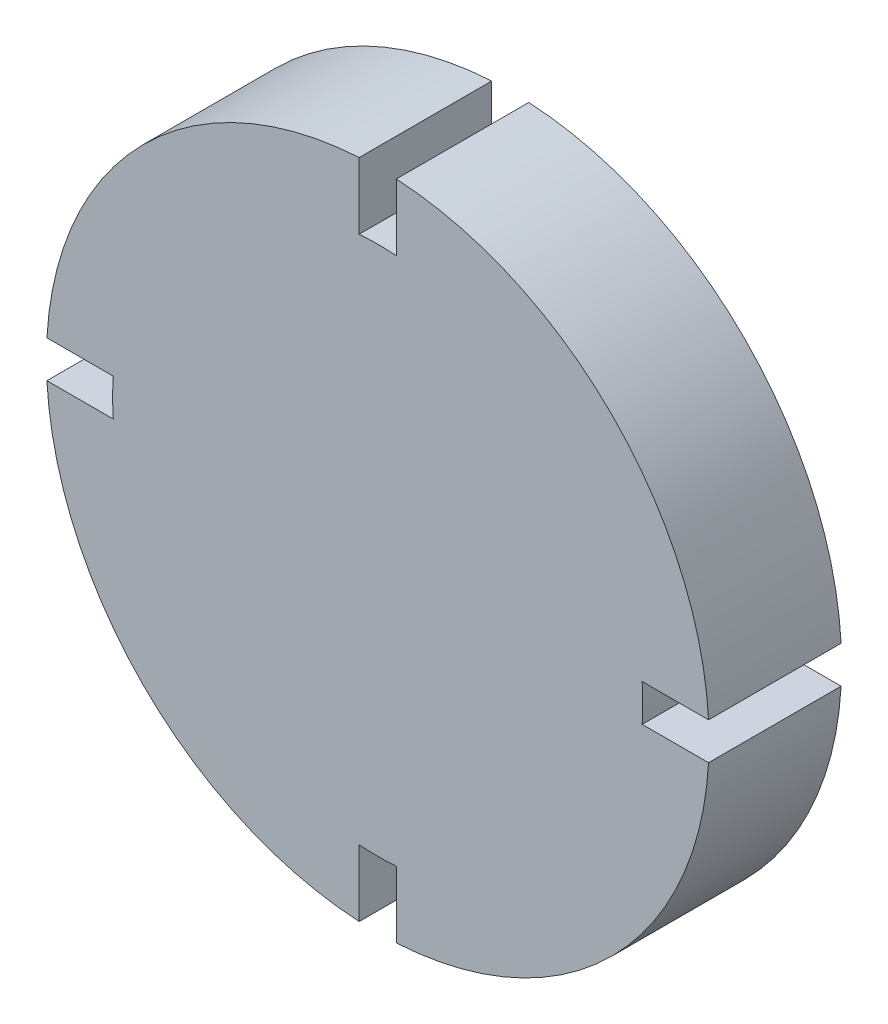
ISO-10303-21;
HEADER;
FILE_DESCRIPTION(('STEP AP214'),'2;1');
FILE_NAME('part.step','',(''),(''),'','','');
FILE_SCHEMA(('AUTOMOTIVE_DESIGN { 1 0 10303 214 1 1 1 1 }'));
ENDSEC;
DATA;
#1=APPLICATION_CONTEXT('core data for automotive mechanical design processes');
#2=APPLICATION_PROTOCOL_DEFINITION('international standard','automotive_design',2000,#1);
#3=PRODUCT_CONTEXT('',#1,'mechanical');
#4=PRODUCT('Part','Part','',(#3));
#5=PRODUCT_RELATED_PRODUCT_CATEGORY('part','',(#4));
#6=PRODUCT_DEFINITION_FORMATION('','',#4);
#7=PRODUCT_DEFINITION_CONTEXT('part definition',#1,'design');
#8=PRODUCT_DEFINITION('design','',#6,#7);
#9=PRODUCT_DEFINITION_SHAPE('','',#8);
#10=(LENGTH_UNIT() NAMED_UNIT(*) SI_UNIT(.MILLI.,.METRE.));
#11=(NAMED_UNIT(*) PLANE_ANGLE_UNIT() SI_UNIT($,.RADIAN.));
#12=(NAMED_UNIT(*) SI_UNIT($,.STERADIAN.) SOLID_ANGLE_UNIT());
#13=UNCERTAINTY_MEASURE_WITH_UNIT(LENGTH_MEASURE(1.E-05),#10,'distance_accuracy_value','');
#14=(GEOMETRIC_REPRESENTATION_CONTEXT(3) GLOBAL_UNCERTAINTY_ASSIGNED_CONTEXT((#13)) GLOBAL_UNIT_ASSIGNED_CONTEXT((#10,
#11,#12)) REPRESENTATION_CONTEXT('',''));
#15=CARTESIAN_POINT('',(0.,0.,0.));
#16=DIRECTION('',(0.,0.,1.));
#17=DIRECTION('',(1.,0.,0.));
#18=AXIS2_PLACEMENT_3D('',#15,#16,#17);
#19=CARTESIAN_POINT('',(0.,0.,10.));
#20=DIRECTION('',(0.,0.,-1.));
#21=DIRECTION('',(-1.,0.,0.));
#22=AXIS2_PLACEMENT_3D('',#19,#20,#21);
#23=CYLINDRICAL_SURFACE('',#22,25.);
#24=CARTESIAN_POINT('',(0.,0.,0.));
#25=DIRECTION('',(0.,0.,1.));
#26=DIRECTION('',(1.,0.,0.));
#27=AXIS2_PLACEMENT_3D('',#24,#25,#26);
#28=CIRCLE('',#27,25.);
#29=CARTESIAN_POINT('',(-1.4,24.9607692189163,0.));
#30=VERTEX_POINT('',#29);
#31=CARTESIAN_POINT('',(-24.9607692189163,1.4,0.));
#32=VERTEX_POINT('',#31);
#33=EDGE_CURVE('E177',#30,#32,#28,.T.);
#34=ORIENTED_EDGE('',*,*,#33,.T.);
#35=DIRECTION('',(0.,0.,-1.));
#36=VECTOR('',#35,1.);
#37=CARTESIAN_POINT('',(-24.9607692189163,1.4,10.));
#38=LINE('',#37,#36);
#39=CARTESIAN_POINT('',(-24.9607692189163,1.4,10.));
#40=VERTEX_POINT('',#39);
#41=EDGE_CURVE('E11',#40,#32,#38,.T.);
#42=ORIENTED_EDGE('',*,*,#41,.F.);
#43=CARTESIAN_POINT('',(0.,0.,10.));
#44=DIRECTION('',(0.,0.,1.));
#45=DIRECTION('',(1.,0.,0.));
#46=AXIS2_PLACEMENT_3D('',#43,#44,#45);
#47=CIRCLE('',#46,25.);
#48=CARTESIAN_POINT('',(-1.4,24.9607692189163,10.));
#49=VERTEX_POINT('',#48);
#50=EDGE_CURVE('E207',#49,#40,#47,.T.);
#51=ORIENTED_EDGE('',*,*,#50,.F.);
#52=DIRECTION('',(0.,0.,-1.));
#53=VECTOR('',#52,1.);
#54=CARTESIAN_POINT('',(-1.4,24.9607692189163,10.));
#55=LINE('',#54,#53);
#56=EDGE_CURVE('E173',#49,#30,#55,.T.);
#57=ORIENTED_EDGE('',*,*,#56,.T.);
#58=EDGE_LOOP('',(#34,#42,#51,#57));
#59=FACE_BOUND('',#58,.T.);
#60=ADVANCED_FACE('F33',(#59),#23,.T.);
#61=CARTESIAN_POINT('',(-24.9607692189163,1.4,10.));
#62=DIRECTION('',(0.,1.,0.));
#63=DIRECTION('',(-1.,0.,0.));
#64=AXIS2_PLACEMENT_3D('',#61,#62,#63);
#65=PLANE('',#64);
#66=DIRECTION('',(1.,0.,0.));
#67=VECTOR('',#66,1.);
#68=CARTESIAN_POINT('',(-24.9607692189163,1.4,0.));
#69=LINE('',#68,#67);
#70=CARTESIAN_POINT('',(-19.9509398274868,1.4,0.));
#71=VERTEX_POINT('',#70);
#72=EDGE_CURVE('E180',#32,#71,#69,.T.);
#73=ORIENTED_EDGE('',*,*,#72,.T.);
#74=DIRECTION('',(0.,0.,-1.));
#75=VECTOR('',#74,1.);
#76=CARTESIAN_POINT('',(-19.9509398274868,1.4,10.));
#77=LINE('',#76,#75);
#78=CARTESIAN_POINT('',(-19.9509398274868,1.4,10.));
#79=VERTEX_POINT('',#78);
#80=EDGE_CURVE('E41',#79,#71,#77,.T.);
#81=ORIENTED_EDGE('',*,*,#80,.F.);
#82=DIRECTION('',(1.,0.,0.));
#83=VECTOR('',#82,1.);
#84=CARTESIAN_POINT('',(-24.9607692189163,1.4,10.));
#85=LINE('',#84,#83);
#86=EDGE_CURVE('E116',#40,#79,#85,.T.);
#87=ORIENTED_EDGE('',*,*,#86,.F.);
#88=ORIENTED_EDGE('',*,*,#41,.T.);
#89=EDGE_LOOP('',(#73,#81,#87,#88));
#90=FACE_BOUND('',#89,.T.);
#91=ADVANCED_FACE('F305',(#90),#65,.F.);
#92=CARTESIAN_POINT('',(0.,0.,10.));
#93=DIRECTION('',(0.,0.,-1.));
#94=DIRECTION('',(-1.,0.,0.));
#95=AXIS2_PLACEMENT_3D('',#92,#93,#94);
#96=CYLINDRICAL_SURFACE('',#95,20.);
#97=CARTESIAN_POINT('',(0.,0.,0.));
#98=DIRECTION('',(0.,0.,1.));
#99=DIRECTION('',(1.,0.,0.));
#100=AXIS2_PLACEMENT_3D('',#97,#98,#99);
#101=CIRCLE('',#100,20.);
#102=CARTESIAN_POINT('',(-19.9509398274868,-1.40000000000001,0.));
#103=VERTEX_POINT('',#102);
#104=EDGE_CURVE('E182',#71,#103,#101,.T.);
#105=ORIENTED_EDGE('',*,*,#104,.T.);
#106=DIRECTION('',(0.,0.,-1.));
#107=VECTOR('',#106,1.);
#108=CARTESIAN_POINT('',(-19.9509398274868,-1.40000000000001,10.));
#109=LINE('',#108,#107);
#110=CARTESIAN_POINT('',(-19.9509398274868,-1.40000000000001,10.));
#111=VERTEX_POINT('',#110);
#112=EDGE_CURVE('E238',#111,#103,#109,.T.);
#113=ORIENTED_EDGE('',*,*,#112,.F.);
#114=CARTESIAN_POINT('',(0.,0.,10.));
#115=DIRECTION('',(0.,0.,1.));
#116=DIRECTION('',(1.,0.,0.));
#117=AXIS2_PLACEMENT_3D('',#114,#115,#116);
#118=CIRCLE('',#117,20.);
#119=EDGE_CURVE('E246',#79,#111,#118,.T.);
#120=ORIENTED_EDGE('',*,*,#119,.F.);
#121=ORIENTED_EDGE('',*,*,#80,.T.);
#122=EDGE_LOOP('',(#105,#113,#120,#121));
#123=FACE_BOUND('',#122,.T.);
#124=ADVANCED_FACE('F244',(#123),#96,.T.);
#125=CARTESIAN_POINT('',(-24.9607692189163,-1.40000000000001,10.));
#126=DIRECTION('',(0.,-1.,0.));
#127=DIRECTION('',(1.,0.,0.));
#128=AXIS2_PLACEMENT_3D('',#125,#126,#127);
#129=PLANE('',#128);
#130=DIRECTION('',(-1.,0.,0.));
#131=VECTOR('',#130,1.);
#132=CARTESIAN_POINT('',(-24.9607692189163,-1.40000000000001,0.));
#133=LINE('',#132,#131);
#134=CARTESIAN_POINT('',(-24.9607692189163,-1.4,0.));
#135=VERTEX_POINT('',#134);
#136=EDGE_CURVE('E184',#103,#135,#133,.T.);
#137=ORIENTED_EDGE('',*,*,#136,.T.);
#138=DIRECTION('',(0.,0.,-1.));
#139=VECTOR('',#138,1.);
#140=CARTESIAN_POINT('',(-24.9607692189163,-1.4,10.));
#141=LINE('',#140,#139);
#142=CARTESIAN_POINT('',(-24.9607692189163,-1.4,10.));
#143=VERTEX_POINT('',#142);
#144=EDGE_CURVE('E235',#143,#135,#141,.T.);
#145=ORIENTED_EDGE('',*,*,#144,.F.);
#146=DIRECTION('',(-1.,0.,0.));
#147=VECTOR('',#146,1.);
#148=CARTESIAN_POINT('',(-24.9607692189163,-1.40000000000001,10.));
#149=LINE('',#148,#147);
#150=EDGE_CURVE('E264',#111,#143,#149,.T.);
#151=ORIENTED_EDGE('',*,*,#150,.F.);
#152=ORIENTED_EDGE('',*,*,#112,.T.);
#153=EDGE_LOOP('',(#137,#145,#151,#152));
#154=FACE_BOUND('',#153,.T.);
#155=ADVANCED_FACE('F255',(#154),#129,.F.);
#156=CARTESIAN_POINT('',(0.,0.,10.));
#157=DIRECTION('',(0.,0.,-1.));
#158=DIRECTION('',(-1.,0.,0.));
#159=AXIS2_PLACEMENT_3D('',#156,#157,#158);
#160=CYLINDRICAL_SURFACE('',#159,25.);
#161=CARTESIAN_POINT('',(0.,0.,0.));
#162=DIRECTION('',(0.,0.,1.));
#163=DIRECTION('',(1.,0.,0.));
#164=AXIS2_PLACEMENT_3D('',#161,#162,#163);
#165=CIRCLE('',#164,25.);
#166=CARTESIAN_POINT('',(-1.4,-24.9607692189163,0.));
#167=VERTEX_POINT('',#166);
#168=EDGE_CURVE('E186',#135,#167,#165,.T.);
#169=ORIENTED_EDGE('',*,*,#168,.T.);
#170=DIRECTION('',(0.,0.,-1.));
#171=VECTOR('',#170,1.);
#172=CARTESIAN_POINT('',(-1.4,-24.9607692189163,10.));
#173=LINE('',#172,#171);
#174=CARTESIAN_POINT('',(-1.4,-24.9607692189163,10.));
#175=VERTEX_POINT('',#174);
#176=EDGE_CURVE('E232',#175,#167,#173,.T.);
#177=ORIENTED_EDGE('',*,*,#176,.F.);
#178=CARTESIAN_POINT('',(0.,0.,10.));
#179=DIRECTION('',(0.,0.,1.));
#180=DIRECTION('',(1.,0.,0.));
#181=AXIS2_PLACEMENT_3D('',#178,#179,#180);
#182=CIRCLE('',#181,25.);
#183=EDGE_CURVE('E261',#143,#175,#182,.T.);
#184=ORIENTED_EDGE('',*,*,#183,.F.);
#185=ORIENTED_EDGE('',*,*,#144,.T.);
#186=EDGE_LOOP('',(#169,#177,#184,#185));
#187=FACE_BOUND('',#186,.T.);
#188=ADVANCED_FACE('F259',(#187),#160,.T.);
#189=CARTESIAN_POINT('',(-1.4,-24.9607692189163,10.));
#190=DIRECTION('',(-1.,0.,0.));
#191=DIRECTION('',(0.,-1.,0.));
#192=AXIS2_PLACEMENT_3D('',#189,#190,#191);
#193=PLANE('',#192);
#194=DIRECTION('',(0.,1.,0.));
#195=VECTOR('',#194,1.);
#196=CARTESIAN_POINT('',(-1.4,-24.9607692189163,0.));
#197=LINE('',#196,#195);
#198=CARTESIAN_POINT('',(-1.4,-19.9509398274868,0.));
#199=VERTEX_POINT('',#198);
#200=EDGE_CURVE('E188',#167,#199,#197,.T.);
#201=ORIENTED_EDGE('',*,*,#200,.T.);
#202=DIRECTION('',(0.,0.,-1.));
#203=VECTOR('',#202,1.);
#204=CARTESIAN_POINT('',(-1.4,-19.9509398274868,10.));
#205=LINE('',#204,#203);
#206=CARTESIAN_POINT('',(-1.4,-19.9509398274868,10.));
#207=VERTEX_POINT('',#206);
#208=EDGE_CURVE('E229',#207,#199,#205,.T.);
#209=ORIENTED_EDGE('',*,*,#208,.F.);
#210=DIRECTION('',(0.,1.,0.));
#211=VECTOR('',#210,1.);
#212=CARTESIAN_POINT('',(-1.4,-24.9607692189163,10.));
#213=LINE('',#212,#211);
#214=EDGE_CURVE('E263',#175,#207,#213,.T.);
#215=ORIENTED_EDGE('',*,*,#214,.F.);
#216=ORIENTED_EDGE('',*,*,#176,.T.);
#217=EDGE_LOOP('',(#201,#209,#215,#216));
#218=FACE_BOUND('',#217,.T.);
#219=ADVANCED_FACE('F318',(#218),#193,.F.);
#220=CARTESIAN_POINT('',(0.,0.,10.));
#221=DIRECTION('',(0.,0.,-1.));
#222=DIRECTION('',(-1.,0.,0.));
#223=AXIS2_PLACEMENT_3D('',#220,#221,#222);
#224=CYLINDRICAL_SURFACE('',#223,20.);
#225=CARTESIAN_POINT('',(0.,0.,0.));
#226=DIRECTION('',(0.,0.,1.));
#227=DIRECTION('',(1.,0.,0.));
#228=AXIS2_PLACEMENT_3D('',#225,#226,#227);
#229=CIRCLE('',#228,20.);
#230=CARTESIAN_POINT('',(1.40000000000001,-19.9509398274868,0.));
#231=VERTEX_POINT('',#230);
#232=EDGE_CURVE('E190',#199,#231,#229,.T.);
#233=ORIENTED_EDGE('',*,*,#232,.T.);
#234=DIRECTION('',(0.,0.,-1.));
#235=VECTOR('',#234,1.);
#236=CARTESIAN_POINT('',(1.40000000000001,-19.9509398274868,10.));
#237=LINE('',#236,#235);
#238=CARTESIAN_POINT('',(1.40000000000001,-19.9509398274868,10.));
#239=VERTEX_POINT('',#238);
#240=EDGE_CURVE('E226',#239,#231,#237,.T.);
#241=ORIENTED_EDGE('',*,*,#240,.F.);
#242=CARTESIAN_POINT('',(0.,0.,10.));
#243=DIRECTION('',(0.,0.,1.));
#244=DIRECTION('',(1.,0.,0.));
#245=AXIS2_PLACEMENT_3D('',#242,#243,#244);
#246=CIRCLE('',#245,20.);
#247=EDGE_CURVE('E266',#207,#239,#246,.T.);
#248=ORIENTED_EDGE('',*,*,#247,.F.);
#249=ORIENTED_EDGE('',*,*,#208,.T.);
#250=EDGE_LOOP('',(#233,#241,#248,#249));
#251=FACE_BOUND('',#250,.T.);
#252=ADVANCED_FACE('F321',(#251),#224,.T.);
#253=CARTESIAN_POINT('',(1.40000000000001,-24.9607692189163,10.));
#254=DIRECTION('',(1.,0.,0.));
#255=DIRECTION('',(0.,0.,-1.));
#256=AXIS2_PLACEMENT_3D('',#253,#254,#255);
#257=PLANE('',#256);
#258=DIRECTION('',(0.,-1.,0.));
#259=VECTOR('',#258,1.);
#260=CARTESIAN_POINT('',(1.40000000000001,-24.9607692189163,0.));
#261=LINE('',#260,#259);
#262=CARTESIAN_POINT('',(1.4,-24.9607692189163,0.));
#263=VERTEX_POINT('',#262);
#264=EDGE_CURVE('E192',#231,#263,#261,.T.);
#265=ORIENTED_EDGE('',*,*,#264,.T.);
#266=DIRECTION('',(0.,0.,-1.));
#267=VECTOR('',#266,1.);
#268=CARTESIAN_POINT('',(1.4,-24.9607692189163,10.));
#269=LINE('',#268,#267);
#270=CARTESIAN_POINT('',(1.4,-24.9607692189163,10.));
#271=VERTEX_POINT('',#270);
#272=EDGE_CURVE('E223',#271,#263,#269,.T.);
#273=ORIENTED_EDGE('',*,*,#272,.F.);
#274=DIRECTION('',(0.,-1.,0.));
#275=VECTOR('',#274,1.);
#276=CARTESIAN_POINT('',(1.40000000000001,-24.9607692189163,10.));
#277=LINE('',#276,#275);
#278=EDGE_CURVE('E272',#239,#271,#277,.T.);
#279=ORIENTED_EDGE('',*,*,#278,.F.);
#280=ORIENTED_EDGE('',*,*,#240,.T.);
#281=EDGE_LOOP('',(#265,#273,#279,#280));
#282=FACE_BOUND('',#281,.T.);
#283=ADVANCED_FACE('F325',(#282),#257,.F.);
#284=CARTESIAN_POINT('',(0.,0.,10.));
#285=DIRECTION('',(0.,0.,-1.));
#286=DIRECTION('',(-1.,0.,0.));
#287=AXIS2_PLACEMENT_3D('',#284,#285,#286);
#288=CYLINDRICAL_SURFACE('',#287,25.);
#289=CARTESIAN_POINT('',(0.,0.,0.));
#290=DIRECTION('',(0.,0.,1.));
#291=DIRECTION('',(1.,0.,0.));
#292=AXIS2_PLACEMENT_3D('',#289,#290,#291);
#293=CIRCLE('',#292,25.);
#294=CARTESIAN_POINT('',(24.9607692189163,-1.4,0.));
#295=VERTEX_POINT('',#294);
#296=EDGE_CURVE('E194',#263,#295,#293,.T.);
#297=ORIENTED_EDGE('',*,*,#296,.T.);
#298=DIRECTION('',(0.,0.,-1.));
#299=VECTOR('',#298,1.);
#300=CARTESIAN_POINT('',(24.9607692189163,-1.4,10.));
#301=LINE('',#300,#299);
#302=CARTESIAN_POINT('',(24.9607692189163,-1.4,10.));
#303=VERTEX_POINT('',#302);
#304=EDGE_CURVE('E220',#303,#295,#301,.T.);
#305=ORIENTED_EDGE('',*,*,#304,.F.);
#306=CARTESIAN_POINT('',(0.,0.,10.));
#307=DIRECTION('',(0.,0.,1.));
#308=DIRECTION('',(1.,0.,0.));
#309=AXIS2_PLACEMENT_3D('',#306,#307,#308);
#310=CIRCLE('',#309,25.);
#311=EDGE_CURVE('E274',#271,#303,#310,.T.);
#312=ORIENTED_EDGE('',*,*,#311,.F.);
#313=ORIENTED_EDGE('',*,*,#272,.T.);
#314=EDGE_LOOP('',(#297,#305,#312,#313));
#315=FACE_BOUND('',#314,.T.);
#316=ADVANCED_FACE('F329',(#315),#288,.T.);
#317=CARTESIAN_POINT('',(24.9607692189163,-1.4,10.));
#318=DIRECTION('',(0.,-1.,0.));
#319=DIRECTION('',(1.,0.,0.));
#320=AXIS2_PLACEMENT_3D('',#317,#318,#319);
#321=PLANE('',#320);
#322=DIRECTION('',(-1.,0.,0.));
#323=VECTOR('',#322,1.);
#324=CARTESIAN_POINT('',(24.9607692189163,-1.4,0.));
#325=LINE('',#324,#323);
#326=CARTESIAN_POINT('',(19.9509398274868,-1.40000000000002,0.));
#327=VERTEX_POINT('',#326);
#328=EDGE_CURVE('E196',#295,#327,#325,.T.);
#329=ORIENTED_EDGE('',*,*,#328,.T.);
#330=DIRECTION('',(0.,0.,-1.));
#331=VECTOR('',#330,1.);
#332=CARTESIAN_POINT('',(19.9509398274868,-1.40000000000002,10.));
#333=LINE('',#332,#331);
#334=CARTESIAN_POINT('',(19.9509398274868,-1.40000000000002,10.));
#335=VERTEX_POINT('',#334);
#336=EDGE_CURVE('E217',#335,#327,#333,.T.);
#337=ORIENTED_EDGE('',*,*,#336,.F.);
#338=DIRECTION('',(-1.,0.,0.));
#339=VECTOR('',#338,1.);
#340=CARTESIAN_POINT('',(24.9607692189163,-1.4,10.));
#341=LINE('',#340,#339);
#342=EDGE_CURVE('E276',#303,#335,#341,.T.);
#343=ORIENTED_EDGE('',*,*,#342,.F.);
#344=ORIENTED_EDGE('',*,*,#304,.T.);
#345=EDGE_LOOP('',(#329,#337,#343,#344));
#346=FACE_BOUND('',#345,.T.);
#347=ADVANCED_FACE('F333',(#346),#321,.F.);
#348=CARTESIAN_POINT('',(0.,0.,10.));
#349=DIRECTION('',(0.,0.,-1.));
#350=DIRECTION('',(-1.,0.,0.));
#351=AXIS2_PLACEMENT_3D('',#348,#349,#350);
#352=CYLINDRICAL_SURFACE('',#351,20.);
#353=CARTESIAN_POINT('',(0.,0.,0.));
#354=DIRECTION('',(0.,0.,1.));
#355=DIRECTION('',(1.,0.,0.));
#356=AXIS2_PLACEMENT_3D('',#353,#354,#355);
#357=CIRCLE('',#356,20.);
#358=CARTESIAN_POINT('',(19.9509398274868,1.40000000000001,0.));
#359=VERTEX_POINT('',#358);
#360=EDGE_CURVE('E198',#327,#359,#357,.T.);
#361=ORIENTED_EDGE('',*,*,#360,.T.);
#362=DIRECTION('',(0.,0.,-1.));
#363=VECTOR('',#362,1.);
#364=CARTESIAN_POINT('',(19.9509398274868,1.40000000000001,10.));
#365=LINE('',#364,#363);
#366=CARTESIAN_POINT('',(19.9509398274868,1.40000000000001,10.));
#367=VERTEX_POINT('',#366);
#368=EDGE_CURVE('E214',#367,#359,#365,.T.);
#369=ORIENTED_EDGE('',*,*,#368,.F.);
#370=CARTESIAN_POINT('',(0.,0.,10.));
#371=DIRECTION('',(0.,0.,1.));
#372=DIRECTION('',(1.,0.,0.));
#373=AXIS2_PLACEMENT_3D('',#370,#371,#372);
#374=CIRCLE('',#373,20.);
#375=EDGE_CURVE('E278',#335,#367,#374,.T.);
#376=ORIENTED_EDGE('',*,*,#375,.F.);
#377=ORIENTED_EDGE('',*,*,#336,.T.);
#378=EDGE_LOOP('',(#361,#369,#376,#377));
#379=FACE_BOUND('',#378,.T.);
#380=ADVANCED_FACE('F337',(#379),#352,.T.);
#381=CARTESIAN_POINT('',(24.9607692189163,1.40000000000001,10.));
#382=DIRECTION('',(0.,1.,0.));
#383=DIRECTION('',(-1.,0.,0.));
#384=AXIS2_PLACEMENT_3D('',#381,#382,#383);
#385=PLANE('',#384);
#386=DIRECTION('',(1.,0.,0.));
#387=VECTOR('',#386,1.);
#388=CARTESIAN_POINT('',(24.9607692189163,1.40000000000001,0.));
#389=LINE('',#388,#387);
#390=CARTESIAN_POINT('',(24.9607692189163,1.40000000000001,0.));
#391=VERTEX_POINT('',#390);
#392=EDGE_CURVE('E200',#359,#391,#389,.T.);
#393=ORIENTED_EDGE('',*,*,#392,.T.);
#394=DIRECTION('',(0.,0.,-1.));
#395=VECTOR('',#394,1.);
#396=CARTESIAN_POINT('',(24.9607692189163,1.40000000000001,10.));
#397=LINE('',#396,#395);
#398=CARTESIAN_POINT('',(24.9607692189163,1.40000000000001,10.));
#399=VERTEX_POINT('',#398);
#400=EDGE_CURVE('E211',#399,#391,#397,.T.);
#401=ORIENTED_EDGE('',*,*,#400,.F.);
#402=DIRECTION('',(1.,0.,0.));
#403=VECTOR('',#402,1.);
#404=CARTESIAN_POINT('',(24.9607692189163,1.40000000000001,10.));
#405=LINE('',#404,#403);
#406=EDGE_CURVE('E280',#367,#399,#405,.T.);
#407=ORIENTED_EDGE('',*,*,#406,.F.);
#408=ORIENTED_EDGE('',*,*,#368,.T.);
#409=EDGE_LOOP('',(#393,#401,#407,#408));
#410=FACE_BOUND('',#409,.T.);
#411=ADVANCED_FACE('F286',(#410),#385,.F.);
#412=CARTESIAN_POINT('',(0.,0.,10.));
#413=DIRECTION('',(0.,0.,-1.));
#414=DIRECTION('',(-1.,0.,0.));
#415=AXIS2_PLACEMENT_3D('',#412,#413,#414);
#416=CYLINDRICAL_SURFACE('',#415,25.);
#417=CARTESIAN_POINT('',(0.,0.,0.));
#418=DIRECTION('',(0.,0.,1.));
#419=DIRECTION('',(1.,0.,0.));
#420=AXIS2_PLACEMENT_3D('',#417,#418,#419);
#421=CIRCLE('',#420,25.);
#422=CARTESIAN_POINT('',(1.4,24.9607692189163,0.));
#423=VERTEX_POINT('',#422);
#424=EDGE_CURVE('E202',#391,#423,#421,.T.);
#425=ORIENTED_EDGE('',*,*,#424,.T.);
#426=DIRECTION('',(0.,0.,-1.));
#427=VECTOR('',#426,1.);
#428=CARTESIAN_POINT('',(1.4,24.9607692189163,10.));
#429=LINE('',#428,#427);
#430=CARTESIAN_POINT('',(1.4,24.9607692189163,10.));
#431=VERTEX_POINT('',#430);
#432=EDGE_CURVE('E168',#431,#423,#429,.T.);
#433=ORIENTED_EDGE('',*,*,#432,.F.);
#434=CARTESIAN_POINT('',(0.,0.,10.));
#435=DIRECTION('',(0.,0.,1.));
#436=DIRECTION('',(1.,0.,0.));
#437=AXIS2_PLACEMENT_3D('',#434,#435,#436);
#438=CIRCLE('',#437,25.);
#439=EDGE_CURVE('E159',#399,#431,#438,.T.);
#440=ORIENTED_EDGE('',*,*,#439,.F.);
#441=ORIENTED_EDGE('',*,*,#400,.T.);
#442=EDGE_LOOP('',(#425,#433,#440,#441));
#443=FACE_BOUND('',#442,.T.);
#444=ADVANCED_FACE('F290',(#443),#416,.T.);
#445=CARTESIAN_POINT('',(1.4,24.9607692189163,10.));
#446=DIRECTION('',(1.,0.,0.));
#447=DIRECTION('',(0.,1.,0.));
#448=AXIS2_PLACEMENT_3D('',#445,#446,#447);
#449=PLANE('',#448);
#450=DIRECTION('',(0.,-1.,0.));
#451=VECTOR('',#450,1.);
#452=CARTESIAN_POINT('',(1.4,24.9607692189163,0.));
#453=LINE('',#452,#451);
#454=CARTESIAN_POINT('',(1.40000000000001,19.9509398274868,0.));
#455=VERTEX_POINT('',#454);
#456=EDGE_CURVE('E167',#423,#455,#453,.T.);
#457=ORIENTED_EDGE('',*,*,#456,.T.);
#458=DIRECTION('',(0.,0.,-1.));
#459=VECTOR('',#458,1.);
#460=CARTESIAN_POINT('',(1.40000000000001,19.9509398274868,10.));
#461=LINE('',#460,#459);
#462=CARTESIAN_POINT('',(1.40000000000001,19.9509398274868,10.));
#463=VERTEX_POINT('',#462);
#464=EDGE_CURVE('E164',#463,#455,#461,.T.);
#465=ORIENTED_EDGE('',*,*,#464,.F.);
#466=DIRECTION('',(0.,-1.,0.));
#467=VECTOR('',#466,1.);
#468=CARTESIAN_POINT('',(1.4,24.9607692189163,10.));
#469=LINE('',#468,#467);
#470=EDGE_CURVE('E153',#431,#463,#469,.T.);
#471=ORIENTED_EDGE('',*,*,#470,.F.);
#472=ORIENTED_EDGE('',*,*,#432,.T.);
#473=EDGE_LOOP('',(#457,#465,#471,#472));
#474=FACE_BOUND('',#473,.T.);
#475=ADVANCED_FACE('F165',(#474),#449,.F.);
#476=CARTESIAN_POINT('',(0.,0.,10.));
#477=DIRECTION('',(0.,0.,-1.));
#478=DIRECTION('',(-1.,0.,0.));
#479=AXIS2_PLACEMENT_3D('',#476,#477,#478);
#480=CYLINDRICAL_SURFACE('',#479,20.);
#481=CARTESIAN_POINT('',(0.,0.,0.));
#482=DIRECTION('',(0.,0.,1.));
#483=DIRECTION('',(1.,0.,0.));
#484=AXIS2_PLACEMENT_3D('',#481,#482,#483);
#485=CIRCLE('',#484,20.);
#486=CARTESIAN_POINT('',(-1.4,19.9509398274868,0.));
#487=VERTEX_POINT('',#486);
#488=EDGE_CURVE('E102',#455,#487,#485,.T.);
#489=ORIENTED_EDGE('',*,*,#488,.T.);
#490=DIRECTION('',(0.,0.,-1.));
#491=VECTOR('',#490,1.);
#492=CARTESIAN_POINT('',(-1.4,19.9509398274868,10.));
#493=LINE('',#492,#491);
#494=CARTESIAN_POINT('',(-1.4,19.9509398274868,10.));
#495=VERTEX_POINT('',#494);
#496=EDGE_CURVE('E169',#495,#487,#493,.T.);
#497=ORIENTED_EDGE('',*,*,#496,.F.);
#498=CARTESIAN_POINT('',(0.,0.,10.));
#499=DIRECTION('',(0.,0.,1.));
#500=DIRECTION('',(1.,0.,0.));
#501=AXIS2_PLACEMENT_3D('',#498,#499,#500);
#502=CIRCLE('',#501,20.);
#503=EDGE_CURVE('E157',#463,#495,#502,.T.);
#504=ORIENTED_EDGE('',*,*,#503,.F.);
#505=ORIENTED_EDGE('',*,*,#464,.T.);
#506=EDGE_LOOP('',(#489,#497,#504,#505));
#507=FACE_BOUND('',#506,.T.);
#508=ADVANCED_FACE('F171',(#507),#480,.T.);
#509=CARTESIAN_POINT('',(-1.4,24.9607692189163,10.));
#510=DIRECTION('',(-1.,0.,0.));
#511=DIRECTION('',(0.,-1.,0.));
#512=AXIS2_PLACEMENT_3D('',#509,#510,#511);
#513=PLANE('',#512);
#514=DIRECTION('',(0.,1.,0.));
#515=VECTOR('',#514,1.);
#516=CARTESIAN_POINT('',(-1.4,24.9607692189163,0.));
#517=LINE('',#516,#515);
#518=EDGE_CURVE('E108',#487,#30,#517,.T.);
#519=ORIENTED_EDGE('',*,*,#518,.T.);
#520=ORIENTED_EDGE('',*,*,#56,.F.);
#521=DIRECTION('',(0.,1.,0.));
#522=VECTOR('',#521,1.);
#523=CARTESIAN_POINT('',(-1.4,24.9607692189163,10.));
#524=LINE('',#523,#522);
#525=EDGE_CURVE('E49',#495,#49,#524,.T.);
#526=ORIENTED_EDGE('',*,*,#525,.F.);
#527=ORIENTED_EDGE('',*,*,#496,.T.);
#528=EDGE_LOOP('',(#519,#520,#526,#527));
#529=FACE_BOUND('',#528,.T.);
#530=ADVANCED_FACE('F294',(#529),#513,.F.);
#531=CARTESIAN_POINT('',(0.,0.,10.));
#532=DIRECTION('',(0.,0.,1.));
#533=DIRECTION('',(1.,0.,0.));
#534=AXIS2_PLACEMENT_3D('',#531,#532,#533);
#535=PLANE('',#534);
#536=ORIENTED_EDGE('',*,*,#50,.T.);
#537=ORIENTED_EDGE('',*,*,#86,.T.);
#538=ORIENTED_EDGE('',*,*,#119,.T.);
#539=ORIENTED_EDGE('',*,*,#150,.T.);
#540=ORIENTED_EDGE('',*,*,#183,.T.);
#541=ORIENTED_EDGE('',*,*,#214,.T.);
#542=ORIENTED_EDGE('',*,*,#247,.T.);
#543=ORIENTED_EDGE('',*,*,#278,.T.);
#544=ORIENTED_EDGE('',*,*,#311,.T.);
#545=ORIENTED_EDGE('',*,*,#342,.T.);
#546=ORIENTED_EDGE('',*,*,#375,.T.);
#547=ORIENTED_EDGE('',*,*,#406,.T.);
#548=ORIENTED_EDGE('',*,*,#439,.T.);
#549=ORIENTED_EDGE('',*,*,#470,.T.);
#550=ORIENTED_EDGE('',*,*,#503,.T.);
#551=ORIENTED_EDGE('',*,*,#525,.T.);
#552=EDGE_LOOP('',(#536,#537,#538,#539,#540,#541,#542,#543,#544,#545,#546,#547,#548,#549,#550,#551));
#553=FACE_BOUND('',#552,.T.);
#554=ADVANCED_FACE('F155',(#553),#535,.T.);
#555=CARTESIAN_POINT('',(0.,0.,0.));
#556=DIRECTION('',(0.,0.,1.));
#557=DIRECTION('',(1.,0.,0.));
#558=AXIS2_PLACEMENT_3D('',#555,#556,#557);
#559=PLANE('',#558);
#560=ORIENTED_EDGE('',*,*,#33,.F.);
#561=ORIENTED_EDGE('',*,*,#518,.F.);
#562=ORIENTED_EDGE('',*,*,#488,.F.);
#563=ORIENTED_EDGE('',*,*,#456,.F.);
#564=ORIENTED_EDGE('',*,*,#424,.F.);
#565=ORIENTED_EDGE('',*,*,#392,.F.);
#566=ORIENTED_EDGE('',*,*,#360,.F.);
#567=ORIENTED_EDGE('',*,*,#328,.F.);
#568=ORIENTED_EDGE('',*,*,#296,.F.);
#569=ORIENTED_EDGE('',*,*,#264,.F.);
#570=ORIENTED_EDGE('',*,*,#232,.F.);
#571=ORIENTED_EDGE('',*,*,#200,.F.);
#572=ORIENTED_EDGE('',*,*,#168,.F.);
#573=ORIENTED_EDGE('',*,*,#136,.F.);
#574=ORIENTED_EDGE('',*,*,#104,.F.);
#575=ORIENTED_EDGE('',*,*,#72,.F.);
#576=EDGE_LOOP('',(#560,#561,#562,#563,#564,#565,#566,#567,#568,#569,#570,#571,#572,#573,#574,#575));
#577=FACE_BOUND('',#576,.T.);
#578=ADVANCED_FACE('F250',(#577),#559,.F.);
#579=CLOSED_SHELL('',(#60,#91,#124,#155,#188,#219,#252,#283,#316,#347,#380,#411,#444,#475,#508,
#530,#554,#578));
#580=MANIFOLD_SOLID_BREP('B2',#579);
#581=ADVANCED_BREP_SHAPE_REPRESENTATION('',(#18,#580),#14);
#582=SHAPE_DEFINITION_REPRESENTATION(#9,#581);
ENDSEC;
END-ISO-10303-21;
